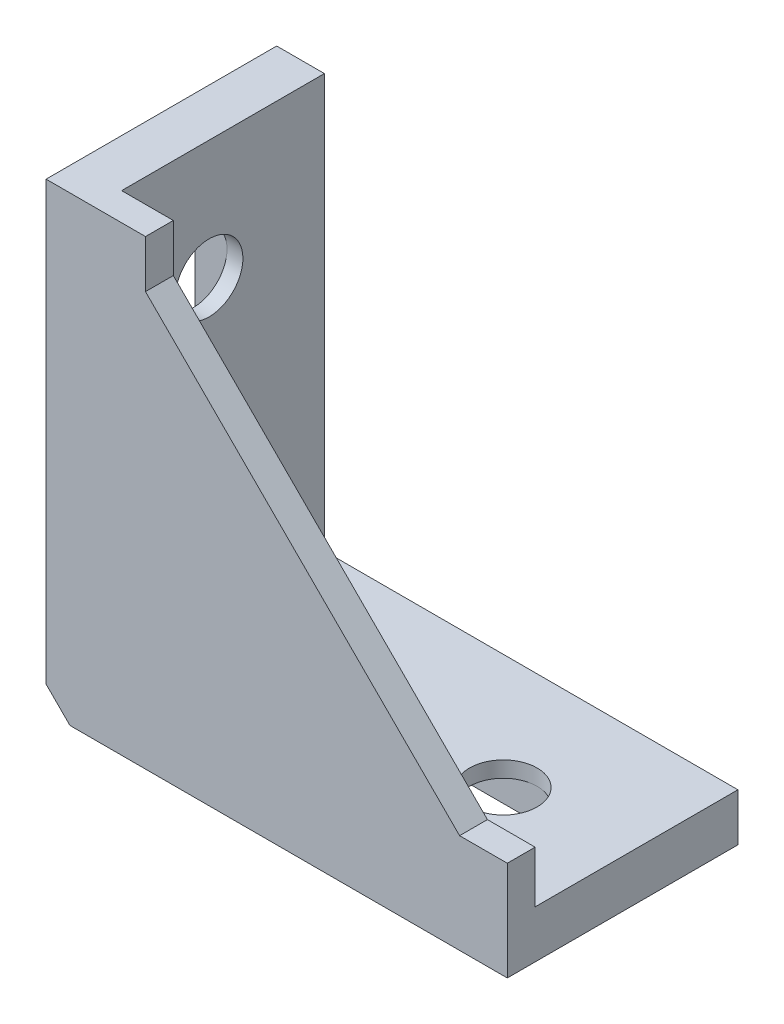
from build123d import *

# Parameters (mm, degrees)
EXTRUDE_1_DEPTH     = 29
EXTRUDE_2_DEPTH     = 3.5
CUT_EXTRUDE_1_DEPTH = 87.656686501
SKETCH_4_W          = 5
SKETCH_4_H          = 47.176431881
SKETCH_4_W_2        = 4
SKETCH_4_H_2        = 47.779487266
CUT_EXTRUDE_2_DEPTH = 4
SKETCH_5_W          = 7
SKETCH_5_H          = 2
EXTRUDE_3_DEPTH     = 2
CHAMFER_1_SIZE      = 3


with BuildPart() as part:
    # Sketch 1 → Extrude 1 (new body)
    with BuildSketch(Plane.XY):
        Polygon((-42.388424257, 57.483748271), (-36.388424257, 57.483748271), (-36.388424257, 5.483748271), (15.611575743, 5.483748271), (15.611575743, -0.516251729), (-42.388424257, -0.516251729), align=None)
    extrude(amount=EXTRUDE_1_DEPTH)

    # Sketch 2 → Extrude 2 (add)
    with BuildSketch(Plane.XY.offset(29)):
        Polygon((-36.388424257, 57.483748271), (-29.888424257, 57.483748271), (-29.888424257, 51.483748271), (9.611575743, 11.983748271), (15.611575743, 11.983748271), (15.611575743, 5.483748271), (-36.388424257, 5.483748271), align=None)
    extrude(amount=-EXTRUDE_2_DEPTH)

    # Sketch 3 → Cut-Extrude 1 (cut, through all)
    with BuildSketch(Plane.ZY.offset(42.388424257)):
        with BuildLine():
            ThreePointArc((18.75, 26.483748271), (17.50520382, 29.488952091), (14.5, 30.733748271))
            Line((14.5, 30.733748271), (14.5, 10.233748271))
            ThreePointArc((14.5, 10.233748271), (17.50520382, 11.478544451), (18.75, 14.483748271))
            Line((18.75, 14.483748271), (18.75, 26.483748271))
        make_face()
        with BuildLine():
            ThreePointArc((18.75, 42.483748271), (17.50520382, 45.488952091), (14.5, 46.733748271))
            Line((14.5, 46.733748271), (14.5, 38.233748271))
            ThreePointArc((14.5, 38.233748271), (17.50520382, 39.478544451), (18.75, 42.483748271))
        make_face()
        with BuildLine():
            Line((14.5, 38.233748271), (14.5, 46.733748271))
            ThreePointArc((14.5, 46.733748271), (10.25, 42.483748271), (14.5, 38.233748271))
        make_face()
        with BuildLine():
            ThreePointArc((18.75, 42.483748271), (17.50520382, 45.488952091), (14.5, 46.733748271))
            Line((14.5, 46.733748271), (14.5, 38.233748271))
            ThreePointArc((14.5, 38.233748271), (17.50520382, 39.478544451), (18.75, 42.483748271))
        make_face()
        with BuildLine():
            Line((14.5, 38.233748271), (14.5, 46.733748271))
            ThreePointArc((14.5, 46.733748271), (10.25, 42.483748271), (14.5, 38.233748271))
        make_face()
        with BuildLine():
            Line((14.5, 10.233748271), (14.5, 30.733748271))
            ThreePointArc((14.5, 30.733748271), (11.49479618, 29.488952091), (10.25, 26.483748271))
            Line((10.25, 26.483748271), (10.25, 14.483748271))
            ThreePointArc((10.25, 14.483748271), (11.49479618, 11.478544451), (14.5, 10.233748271))
        make_face()
    cut_extrude_1 = extrude(amount=-CUT_EXTRUDE_1_DEPTH, mode=Mode.SUBTRACT)

    # Sketch 4 → Cut-Extrude 2 (cut)
    with BuildSketch(Plane.ZY.offset(42.388424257)):
        with Locations((6, 30.071964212)):
            Rectangle(SKETCH_4_W, SKETCH_4_H)
        with BuildLine():
            ThreePointArc((18.75, 42.483748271), (14.5, 38.233748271), (10.25, 42.483748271))
            Line((10.25, 42.483748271), (10.25, 26.483748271))
            ThreePointArc((10.25, 26.483748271), (14.5, 30.733748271), (18.75, 26.483748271))
            Line((18.75, 26.483748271), (18.75, 42.483748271))
        make_face()
        with BuildLine():
            Line((10.25, 50.483748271), (10.25, 42.483748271))
            ThreePointArc((10.25, 42.483748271), (14.5, 46.733748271), (18.75, 42.483748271))
            Line((18.75, 42.483748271), (18.75, 50.483748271))
            Line((18.75, 50.483748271), (10.25, 50.483748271))
        make_face()
        with Locations((23.5, 29.770436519)):
            Rectangle(SKETCH_4_W_2, SKETCH_4_H_2)
        with BuildLine():
            ThreePointArc((18.75, 14.483748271), (14.5, 10.233748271), (10.25, 14.483748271))
            Line((10.25, 14.483748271), (10.25, 6.483748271))
            Line((10.25, 6.483748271), (18.75, 6.483748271))
            Line((18.75, 6.483748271), (18.75, 14.483748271))
        make_face()
    cut_extrude_2 = extrude(amount=-CUT_EXTRUDE_2_DEPTH, mode=Mode.SUBTRACT)

    # Mirror 1: Cut-Extrude 1, Cut-Extrude 2 across plane
    add(cut_extrude_1.mirror(Plane(origin=(-20.936086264, 20.936086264, 0), x_dir=(0, 0, 1), z_dir=(0.7071067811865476, -0.7071067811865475, 0))), mode=Mode.SUBTRACT)
    add(cut_extrude_2.mirror(Plane(origin=(-20.936086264, 20.936086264, 0), x_dir=(0, 0, 1), z_dir=(0.7071067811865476, -0.7071067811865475, 0))), mode=Mode.SUBTRACT)

    # Sketch 5 → Extrude 3 (add)
    with BuildSketch(Plane.ZY.offset(42.388424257)):
        with Locations((15.5, 5.483748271)):
            Rectangle(SKETCH_5_W, SKETCH_5_H)
        with Locations((15.5, 51.483748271)):
            Rectangle(SKETCH_5_W, SKETCH_5_H)
    extrude_3 = extrude(amount=EXTRUDE_3_DEPTH)

    # Mirror 2: Extrude 3 across plane
    add(extrude_3.mirror(Plane(origin=(-20.936086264, 20.936086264, 0), x_dir=(0, 0, 1), z_dir=(0.7071067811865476, -0.7071067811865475, 0))))

    # Chamfer 1
    chamfer_1_edges = [part.edges().sort_by_distance(p)[0] for p in [
        (-42.388424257, -0.516251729, 14.5),
    ]]
    chamfer(chamfer_1_edges, length=CHAMFER_1_SIZE)


solid = part.part
